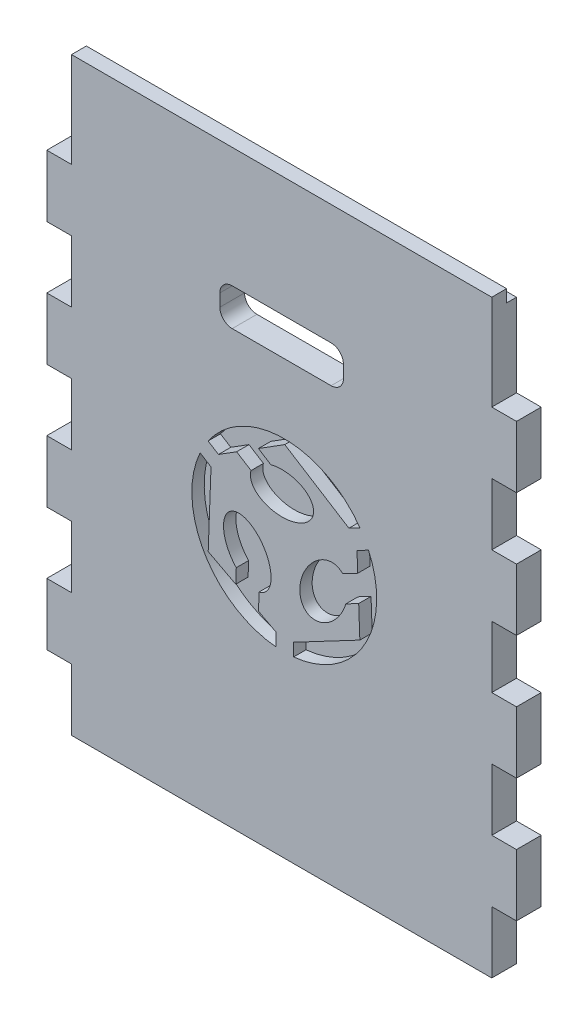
from build123d import *

# Parameters (mm, degrees)
EXTRUDE1_DEPTH = 20
EXTRUDE2_DEPTH = 611.187676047
EXTRUDE3_DEPTH = 10
SKETCH4_W      = 340
SKETCH4_H      = 10
EXTRUDE4_DEPTH = 8


with BuildPart() as part:
    # Sketch1 → Extrude1 (new body)
    with BuildSketch(Plane.XY):
        Polygon((0, 50), (20, 50), (20, 0), (360, 0), (360, 50), (380, 50), (380, 100), (360, 100), (360, 150), (380, 150), (380, 200), (360, 200), (360, 250), (380, 250), (380, 300), (360, 300), (360, 350), (380, 350), (380, 400), (360, 400), (360, 477), (20, 477), (20, 400), (0, 400), (0, 350), (20, 350), (20, 300), (0, 300), (0, 250), (20, 250), (20, 200), (0, 200), (0, 150), (20, 150), (20, 100), (0, 100), align=None)
    extrude(amount=EXTRUDE1_DEPTH)

    # Sketch2 → Extrude2 (cut, through all)
    with BuildSketch(Plane.XY.offset(20)):
        with BuildLine():
            Line((150, 380), (230, 380))
            ThreePointArc((230, 380), (237.071067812, 377.071067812), (240, 370))
            Line((240, 370), (240, 360))
            ThreePointArc((240, 360), (237.071067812, 352.928932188), (230, 350))
            Line((230, 350), (150, 350))
            ThreePointArc((150, 350), (142.928932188, 352.928932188), (140, 360))
            Line((140, 360), (140, 370))
            ThreePointArc((140, 370), (142.928932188, 377.071067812), (150, 380))
        make_face()
    extrude(amount=-EXTRUDE2_DEPTH, mode=Mode.SUBTRACT)

    # Sketch3 → Extrude3 (cut)
    with BuildSketch(Plane.XY.offset(20)):
        with BuildLine():
            Line((252.329517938, 208.557051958), (253.276370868, 183.393956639))
            Line((253.276370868, 183.393956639), (199.66909018, 155.076149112))
            Line((199.66909018, 155.076149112), (199.66909018, 144.764020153))
            ThreePointArc((199.66909018, 144.764020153), (256.914694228, 181.817025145), (260.281386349, 249.924658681))
            Line((260.281386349, 249.924658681), (250.958229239, 244.999742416))
            Line((250.958229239, 244.999742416), (251.546796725, 229.358263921))
            Line((251.546796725, 229.358263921), (239.371909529, 222.926933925))
            add(Edge.make_bspline(
                [(239.371909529, 222.926933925), (225.535201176, 238.237490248), (209.774072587, 211.624637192), (194.012943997, 185.011784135), (213.782981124, 179.719724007), (233.553018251, 174.427663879), (241.871651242, 203.032730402)],
                knots=[2.935135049, 2.935135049, 2.935135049, 4.695287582, 4.695287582, 6.455440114, 6.455440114, 8.215592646, 8.215592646, 8.215592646], degree=2, weights=[1, 0.637092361, 1, 0.637092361, 1, 0.637092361, 1]))
            Line((241.871651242, 203.032730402), (252.329517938, 208.557051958))
        make_face()
        with BuildLine():
            Line((171.212448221, 276.58868973), (192.53090154, 289.990236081))
            Line((192.53090154, 289.990236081), (244.4247871, 257.367873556))
            Line((244.4247871, 257.367873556), (253.354320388, 262.084859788))
            ThreePointArc((253.354320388, 262.084859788), (191.785946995, 293.92880167), (130.51490635, 261.516445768))
            Line((130.51490635, 261.516445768), (138.875623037, 256.260598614))
            Line((138.875623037, 256.260598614), (153.589430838, 265.510227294))
            Line((153.589430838, 265.510227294), (165.246569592, 258.182130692))
            add(Edge.make_bspline(
                [(165.246569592, 258.182130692), (158.905593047, 238.543911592), (189.833564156, 238.200800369), (220.761535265, 237.857689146), (215.459575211, 257.625073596), (210.157615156, 277.392458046), (181.225584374, 270.29407228)],
                knots=[2.935135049, 2.935135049, 2.935135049, 4.695287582, 4.695287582, 6.455440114, 6.455440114, 8.215592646, 8.215592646, 8.215592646], degree=2, weights=[1, 0.637092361, 1, 0.637092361, 1, 0.637092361, 1]))
            Line((181.225584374, 270.29407228), (171.212448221, 276.58868973))
        make_face()
        with BuildLine():
            Line((124.024838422, 250.018273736), (132.860524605, 244.463843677))
            Line((132.860524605, 244.463843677), (130.588550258, 184.084976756))
            Line((130.588550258, 184.084976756), (152.853856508, 172.323427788))
            Line((152.853856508, 172.323427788), (153.29858705, 184.142366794))
            add(Edge.make_bspline(
                [(171.777343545, 176.360104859), (191.955028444, 180.687767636), (176.788185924, 207.643731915), (161.621343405, 234.599696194), (147.153266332, 220.124371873), (132.685189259, 205.649047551), (153.29858705, 184.142366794)],
                knots=[6.076727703, 6.076727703, 6.076727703, 7.836880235, 7.836880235, 9.597032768, 9.597032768, 11.3571853, 11.3571853, 11.3571853], degree=2, weights=[1, 0.637092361, 1, 0.637092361, 1, 0.637092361, 1]))
            Line((171.777343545, 176.360104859), (171.259595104, 162.600678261))
            Line((171.259595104, 162.600678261), (185.418941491, 155.121066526))
            Line((185.418941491, 155.121066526), (185.418941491, 144.685127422))
            ThreePointArc((185.418941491, 144.685127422), (127.53101335, 181.503322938), (124.024838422, 250.018273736))
        make_face()
    extrude(amount=-EXTRUDE3_DEPTH, mode=Mode.SUBTRACT)

    # Sketch4 → Extrude4 (cut)
    with BuildSketch(Plane(origin=(0, 0, 0), x_dir=(-1, 0, 0), z_dir=(0, 0, -1))):
        with Locations((-190, 472)):
            Rectangle(SKETCH4_W, SKETCH4_H)
    extrude(amount=-EXTRUDE4_DEPTH, mode=Mode.SUBTRACT)


solid = part.part
